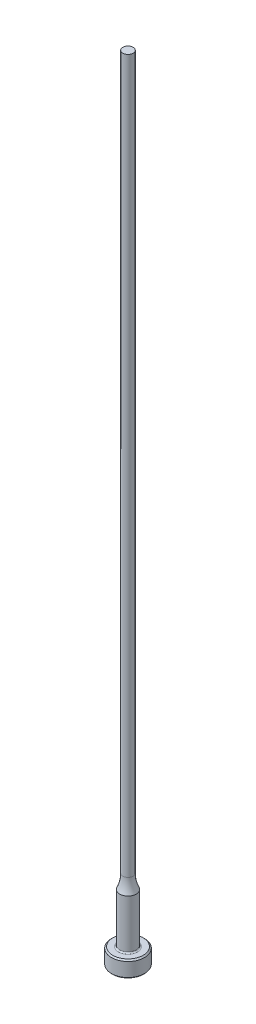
from build123d import *

# Parameters (mm, degrees)
CHAMFER1_SIZE = 0.254
FILLET1_R     = 0.254


with BuildPart() as part:
    # Sketch1 → Revolve1 (revolve)
    with BuildSketch(Plane.XY, mode=Mode.PRIVATE) as revolve1_sk:
        with BuildLine():
            Line((0, 0), (-3.175, 0))
            Line((-3.175, 0), (-3.175, 3.175))
            Line((-3.175, 3.175), (-1.5875, 3.175))
            Line((-1.5875, 3.175), (-1.5875, 12.7))
            ThreePointArc((-1.5875, 12.7), (-1.142565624, 14.009911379), (-0.99187, 15.385093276))
            Line((-0.99187, 15.385093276), (-0.99187, 152.4))
            Line((-0.99187, 152.4), (0, 152.4))
            Line((0, 152.4), (0, 0))
        make_face()
    revolve(revolve1_sk.sketch.rotate(Axis((0, 259.958771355, 0), (0, -1, 0)), 270), axis=Axis((0, 259.958771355, 0), (0, -1, 0)))

    # Chamfer1
    chamfer1_edges = [part.edges().sort_by_distance(p)[0] for p in [
        (0, 0, -3.175),
        (0, 3.175, -3.175),
    ]]
    chamfer(chamfer1_edges, length=CHAMFER1_SIZE)

    # Fillet1
    fillet1_edges = [part.edges().sort_by_distance(p)[0] for p in [
        (0, 3.175, -1.5875),
    ]]
    fillet(fillet1_edges, radius=FILLET1_R)


solid = part.part
